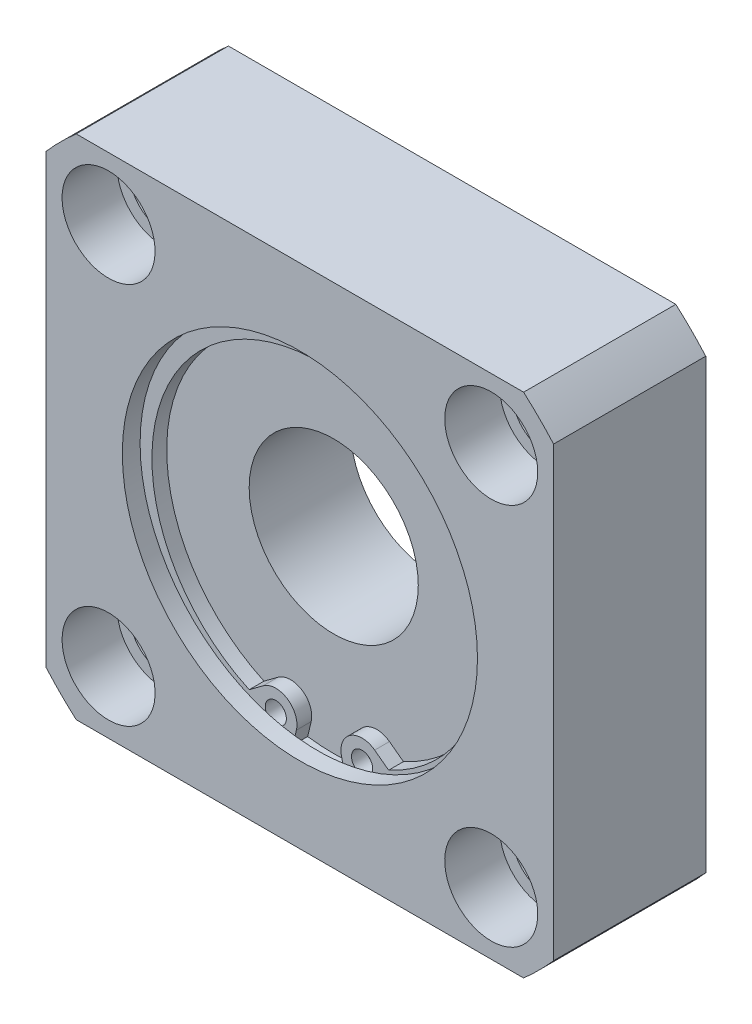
ISO-10303-21;
HEADER;
FILE_DESCRIPTION(('STEP AP214'),'2;1');
FILE_NAME('part.step','',(''),(''),'','','');
FILE_SCHEMA(('AUTOMOTIVE_DESIGN { 1 0 10303 214 1 1 1 1 }'));
ENDSEC;
DATA;
#1=APPLICATION_CONTEXT('core data for automotive mechanical design processes');
#2=APPLICATION_PROTOCOL_DEFINITION('international standard','automotive_design',2000,#1);
#3=PRODUCT_CONTEXT('',#1,'mechanical');
#4=PRODUCT('Part','Part','',(#3));
#5=PRODUCT_RELATED_PRODUCT_CATEGORY('part','',(#4));
#6=PRODUCT_DEFINITION_FORMATION('','',#4);
#7=PRODUCT_DEFINITION_CONTEXT('part definition',#1,'design');
#8=PRODUCT_DEFINITION('design','',#6,#7);
#9=PRODUCT_DEFINITION_SHAPE('','',#8);
#10=(LENGTH_UNIT() NAMED_UNIT(*) SI_UNIT(.MILLI.,.METRE.));
#11=(NAMED_UNIT(*) PLANE_ANGLE_UNIT() SI_UNIT($,.RADIAN.));
#12=(NAMED_UNIT(*) SI_UNIT($,.STERADIAN.) SOLID_ANGLE_UNIT());
#13=UNCERTAINTY_MEASURE_WITH_UNIT(LENGTH_MEASURE(1.E-05),#10,'distance_accuracy_value','');
#14=(GEOMETRIC_REPRESENTATION_CONTEXT(3) GLOBAL_UNCERTAINTY_ASSIGNED_CONTEXT((#13)) GLOBAL_UNIT_ASSIGNED_CONTEXT((#10,
#11,#12)) REPRESENTATION_CONTEXT('',''));
#15=CARTESIAN_POINT('',(0.,0.,0.));
#16=DIRECTION('',(0.,0.,1.));
#17=DIRECTION('',(1.,0.,0.));
#18=AXIS2_PLACEMENT_3D('',#15,#16,#17);
#19=CARTESIAN_POINT('',(22.6274169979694,22.6274169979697,0.));
#20=DIRECTION('',(0.,0.,1.));
#21=DIRECTION('',(1.,0.,0.));
#22=AXIS2_PLACEMENT_3D('',#19,#20,#21);
#23=CYLINDRICAL_SURFACE('',#22,4.);
#24=CARTESIAN_POINT('',(22.6274169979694,22.6274169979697,0.));
#25=DIRECTION('',(0.,0.,1.));
#26=DIRECTION('',(1.,0.,0.));
#27=AXIS2_PLACEMENT_3D('',#24,#25,#26);
#28=CIRCLE('',#27,4.);
#29=CARTESIAN_POINT('',(26.6274169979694,22.6274169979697,0.));
#30=VERTEX_POINT('',#29);
#31=EDGE_CURVE('E318',#30,#30,#28,.T.);
#32=ORIENTED_EDGE('',*,*,#31,.F.);
#33=EDGE_LOOP('',(#32));
#34=FACE_BOUND('',#33,.T.);
#35=CARTESIAN_POINT('',(22.6274169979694,22.6274169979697,11.5));
#36=DIRECTION('',(0.,0.,1.));
#37=DIRECTION('',(1.,0.,0.));
#38=AXIS2_PLACEMENT_3D('',#35,#36,#37);
#39=CIRCLE('',#38,4.);
#40=CARTESIAN_POINT('',(26.6274169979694,22.6274169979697,11.5));
#41=VERTEX_POINT('',#40);
#42=EDGE_CURVE('E315',#41,#41,#39,.F.);
#43=ORIENTED_EDGE('',*,*,#42,.F.);
#44=EDGE_LOOP('',(#43));
#45=FACE_BOUND('',#44,.T.);
#46=ADVANCED_FACE('F14',(#34,#45),#23,.F.);
#47=CARTESIAN_POINT('',(22.6274169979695,-22.6274169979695,0.));
#48=DIRECTION('',(0.,0.,1.));
#49=DIRECTION('',(1.,0.,0.));
#50=AXIS2_PLACEMENT_3D('',#47,#48,#49);
#51=CYLINDRICAL_SURFACE('',#50,4.);
#52=CARTESIAN_POINT('',(22.6274169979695,-22.6274169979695,0.));
#53=DIRECTION('',(0.,0.,1.));
#54=DIRECTION('',(0.,-1.,0.));
#55=AXIS2_PLACEMENT_3D('',#52,#53,#54);
#56=CIRCLE('',#55,4.);
#57=CARTESIAN_POINT('',(22.6274169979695,-26.6274169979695,0.));
#58=VERTEX_POINT('',#57);
#59=EDGE_CURVE('E387',#58,#58,#56,.T.);
#60=ORIENTED_EDGE('',*,*,#59,.F.);
#61=EDGE_LOOP('',(#60));
#62=FACE_BOUND('',#61,.T.);
#63=CARTESIAN_POINT('',(22.6274169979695,-22.6274169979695,11.5));
#64=DIRECTION('',(0.,0.,1.));
#65=DIRECTION('',(1.,0.,0.));
#66=AXIS2_PLACEMENT_3D('',#63,#64,#65);
#67=CIRCLE('',#66,4.);
#68=CARTESIAN_POINT('',(26.6274169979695,-22.6274169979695,11.5));
#69=VERTEX_POINT('',#68);
#70=EDGE_CURVE('E310',#69,#69,#67,.F.);
#71=ORIENTED_EDGE('',*,*,#70,.F.);
#72=EDGE_LOOP('',(#71));
#73=FACE_BOUND('',#72,.T.);
#74=ADVANCED_FACE('F508',(#62,#73),#51,.F.);
#75=CARTESIAN_POINT('',(-22.6274169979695,-22.6274169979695,0.));
#76=DIRECTION('',(0.,0.,1.));
#77=DIRECTION('',(1.,0.,0.));
#78=AXIS2_PLACEMENT_3D('',#75,#76,#77);
#79=CYLINDRICAL_SURFACE('',#78,4.);
#80=CARTESIAN_POINT('',(-22.6274169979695,-22.6274169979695,0.));
#81=DIRECTION('',(0.,0.,1.));
#82=DIRECTION('',(-1.,0.,0.));
#83=AXIS2_PLACEMENT_3D('',#80,#81,#82);
#84=CIRCLE('',#83,4.);
#85=CARTESIAN_POINT('',(-26.6274169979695,-22.6274169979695,0.));
#86=VERTEX_POINT('',#85);
#87=EDGE_CURVE('E390',#86,#86,#84,.T.);
#88=ORIENTED_EDGE('',*,*,#87,.F.);
#89=EDGE_LOOP('',(#88));
#90=FACE_BOUND('',#89,.T.);
#91=CARTESIAN_POINT('',(-22.6274169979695,-22.6274169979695,11.5));
#92=DIRECTION('',(0.,0.,1.));
#93=DIRECTION('',(1.,0.,0.));
#94=AXIS2_PLACEMENT_3D('',#91,#92,#93);
#95=CIRCLE('',#94,4.);
#96=CARTESIAN_POINT('',(-18.6274169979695,-22.6274169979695,11.5));
#97=VERTEX_POINT('',#96);
#98=EDGE_CURVE('E305',#97,#97,#95,.F.);
#99=ORIENTED_EDGE('',*,*,#98,.F.);
#100=EDGE_LOOP('',(#99));
#101=FACE_BOUND('',#100,.T.);
#102=ADVANCED_FACE('F514',(#90,#101),#79,.F.);
#103=CARTESIAN_POINT('',(-22.6274169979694,22.6274169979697,0.));
#104=DIRECTION('',(0.,0.,1.));
#105=DIRECTION('',(1.,0.,0.));
#106=AXIS2_PLACEMENT_3D('',#103,#104,#105);
#107=CYLINDRICAL_SURFACE('',#106,4.);
#108=CARTESIAN_POINT('',(-22.6274169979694,22.6274169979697,0.));
#109=DIRECTION('',(0.,0.,1.));
#110=DIRECTION('',(0.,1.,0.));
#111=AXIS2_PLACEMENT_3D('',#108,#109,#110);
#112=CIRCLE('',#111,4.);
#113=CARTESIAN_POINT('',(-22.6274169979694,26.6274169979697,0.));
#114=VERTEX_POINT('',#113);
#115=EDGE_CURVE('E313',#114,#114,#112,.T.);
#116=ORIENTED_EDGE('',*,*,#115,.F.);
#117=EDGE_LOOP('',(#116));
#118=FACE_BOUND('',#117,.T.);
#119=CARTESIAN_POINT('',(-22.6274169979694,22.6274169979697,11.5));
#120=DIRECTION('',(0.,0.,1.));
#121=DIRECTION('',(1.,0.,0.));
#122=AXIS2_PLACEMENT_3D('',#119,#120,#121);
#123=CIRCLE('',#122,4.);
#124=CARTESIAN_POINT('',(-18.6274169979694,22.6274169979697,11.5));
#125=VERTEX_POINT('',#124);
#126=EDGE_CURVE('E300',#125,#125,#123,.F.);
#127=ORIENTED_EDGE('',*,*,#126,.F.);
#128=EDGE_LOOP('',(#127));
#129=FACE_BOUND('',#128,.T.);
#130=ADVANCED_FACE('F554',(#118,#129),#107,.F.);
#131=CARTESIAN_POINT('',(22.6274169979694,22.6274169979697,11.5));
#132=DIRECTION('',(0.,0.,1.));
#133=DIRECTION('',(1.,0.,0.));
#134=AXIS2_PLACEMENT_3D('',#131,#132,#133);
#135=PLANE('',#134);
#136=CARTESIAN_POINT('',(22.6274169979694,22.6274169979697,11.5));
#137=DIRECTION('',(0.,0.,1.));
#138=DIRECTION('',(1.,0.,0.));
#139=AXIS2_PLACEMENT_3D('',#136,#137,#138);
#140=CIRCLE('',#139,5.5);
#141=CARTESIAN_POINT('',(28.1274169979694,22.6274169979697,11.5));
#142=VERTEX_POINT('',#141);
#143=EDGE_CURVE('E319',#142,#142,#140,.T.);
#144=ORIENTED_EDGE('',*,*,#143,.T.);
#145=EDGE_LOOP('',(#144));
#146=FACE_BOUND('',#145,.T.);
#147=ORIENTED_EDGE('',*,*,#42,.T.);
#148=EDGE_LOOP('',(#147));
#149=FACE_BOUND('',#148,.T.);
#150=ADVANCED_FACE('F545',(#146,#149),#135,.T.);
#151=CARTESIAN_POINT('',(22.6274169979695,-22.6274169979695,11.5));
#152=DIRECTION('',(0.,0.,1.));
#153=DIRECTION('',(0.,-1.,0.));
#154=AXIS2_PLACEMENT_3D('',#151,#152,#153);
#155=PLANE('',#154);
#156=CARTESIAN_POINT('',(22.6274169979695,-22.6274169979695,11.5));
#157=DIRECTION('',(0.,0.,1.));
#158=DIRECTION('',(0.,-1.,0.));
#159=AXIS2_PLACEMENT_3D('',#156,#157,#158);
#160=CIRCLE('',#159,5.5);
#161=CARTESIAN_POINT('',(22.6274169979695,-28.1274169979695,11.5));
#162=VERTEX_POINT('',#161);
#163=EDGE_CURVE('E314',#162,#162,#160,.T.);
#164=ORIENTED_EDGE('',*,*,#163,.T.);
#165=EDGE_LOOP('',(#164));
#166=FACE_BOUND('',#165,.T.);
#167=ORIENTED_EDGE('',*,*,#70,.T.);
#168=EDGE_LOOP('',(#167));
#169=FACE_BOUND('',#168,.T.);
#170=ADVANCED_FACE('F543',(#166,#169),#155,.T.);
#171=CARTESIAN_POINT('',(-22.6274169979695,-22.6274169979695,11.5));
#172=DIRECTION('',(0.,0.,1.));
#173=DIRECTION('',(-1.,0.,0.));
#174=AXIS2_PLACEMENT_3D('',#171,#172,#173);
#175=PLANE('',#174);
#176=CARTESIAN_POINT('',(-22.6274169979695,-22.6274169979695,11.5));
#177=DIRECTION('',(0.,0.,1.));
#178=DIRECTION('',(-1.,0.,0.));
#179=AXIS2_PLACEMENT_3D('',#176,#177,#178);
#180=CIRCLE('',#179,5.5);
#181=CARTESIAN_POINT('',(-28.1274169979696,-22.6274169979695,11.5));
#182=VERTEX_POINT('',#181);
#183=EDGE_CURVE('E309',#182,#182,#180,.T.);
#184=ORIENTED_EDGE('',*,*,#183,.T.);
#185=EDGE_LOOP('',(#184));
#186=FACE_BOUND('',#185,.T.);
#187=ORIENTED_EDGE('',*,*,#98,.T.);
#188=EDGE_LOOP('',(#187));
#189=FACE_BOUND('',#188,.T.);
#190=ADVANCED_FACE('F529',(#186,#189),#175,.T.);
#191=CARTESIAN_POINT('',(-22.6274169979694,22.6274169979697,11.5));
#192=DIRECTION('',(0.,0.,1.));
#193=DIRECTION('',(0.,1.,0.));
#194=AXIS2_PLACEMENT_3D('',#191,#192,#193);
#195=PLANE('',#194);
#196=CARTESIAN_POINT('',(-22.6274169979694,22.6274169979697,11.5));
#197=DIRECTION('',(0.,0.,1.));
#198=DIRECTION('',(0.,1.,0.));
#199=AXIS2_PLACEMENT_3D('',#196,#197,#198);
#200=CIRCLE('',#199,5.5);
#201=CARTESIAN_POINT('',(-22.6274169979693,28.1274169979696,11.5));
#202=VERTEX_POINT('',#201);
#203=EDGE_CURVE('E304',#202,#202,#200,.T.);
#204=ORIENTED_EDGE('',*,*,#203,.T.);
#205=EDGE_LOOP('',(#204));
#206=FACE_BOUND('',#205,.T.);
#207=ORIENTED_EDGE('',*,*,#126,.T.);
#208=EDGE_LOOP('',(#207));
#209=FACE_BOUND('',#208,.T.);
#210=ADVANCED_FACE('F524',(#206,#209),#195,.T.);
#211=CARTESIAN_POINT('',(0.,0.,0.));
#212=DIRECTION('',(0.,0.,-1.));
#213=DIRECTION('',(-1.,0.,0.));
#214=AXIS2_PLACEMENT_3D('',#211,#212,#213);
#215=PLANE('',#214);
#216=CARTESIAN_POINT('',(0.,0.,0.));
#217=DIRECTION('',(0.,0.,-1.));
#218=DIRECTION('',(-1.,0.,0.));
#219=AXIS2_PLACEMENT_3D('',#216,#217,#218);
#220=CIRCLE('',#219,18.);
#221=CARTESIAN_POINT('',(-18.,0.,0.));
#222=VERTEX_POINT('',#221);
#223=EDGE_CURVE('E289',#222,#222,#220,.T.);
#224=ORIENTED_EDGE('',*,*,#223,.F.);
#225=EDGE_LOOP('',(#224));
#226=FACE_BOUND('',#225,.T.);
#227=ORIENTED_EDGE('',*,*,#115,.T.);
#228=EDGE_LOOP('',(#227));
#229=FACE_BOUND('',#228,.T.);
#230=ORIENTED_EDGE('',*,*,#87,.T.);
#231=EDGE_LOOP('',(#230));
#232=FACE_BOUND('',#231,.T.);
#233=ORIENTED_EDGE('',*,*,#59,.T.);
#234=EDGE_LOOP('',(#233));
#235=FACE_BOUND('',#234,.T.);
#236=ORIENTED_EDGE('',*,*,#31,.T.);
#237=EDGE_LOOP('',(#236));
#238=FACE_BOUND('',#237,.T.);
#239=CARTESIAN_POINT('',(0.,0.,0.));
#240=DIRECTION('',(0.,0.,-1.));
#241=DIRECTION('',(-1.,0.,0.));
#242=AXIS2_PLACEMENT_3D('',#239,#240,#241);
#243=CIRCLE('',#242,40.);
#244=CARTESIAN_POINT('',(30.,-26.4575131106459,0.));
#245=VERTEX_POINT('',#244);
#246=CARTESIAN_POINT('',(26.4575131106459,-30.,0.));
#247=VERTEX_POINT('',#246);
#248=EDGE_CURVE('E378',#245,#247,#243,.T.);
#249=ORIENTED_EDGE('',*,*,#248,.T.);
#250=DIRECTION('',(1.,0.,0.));
#251=VECTOR('',#250,1.);
#252=CARTESIAN_POINT('',(-26.4575131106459,-30.,0.));
#253=LINE('',#252,#251);
#254=CARTESIAN_POINT('',(-26.4575131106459,-30.,0.));
#255=VERTEX_POINT('',#254);
#256=EDGE_CURVE('E375',#255,#247,#253,.T.);
#257=ORIENTED_EDGE('',*,*,#256,.F.);
#258=CARTESIAN_POINT('',(0.,0.,0.));
#259=DIRECTION('',(0.,0.,1.));
#260=DIRECTION('',(1.,0.,0.));
#261=AXIS2_PLACEMENT_3D('',#258,#259,#260);
#262=CIRCLE('',#261,40.);
#263=CARTESIAN_POINT('',(-30.,-26.4575131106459,0.));
#264=VERTEX_POINT('',#263);
#265=EDGE_CURVE('E372',#264,#255,#262,.T.);
#266=ORIENTED_EDGE('',*,*,#265,.F.);
#267=DIRECTION('',(0.,1.,0.));
#268=VECTOR('',#267,1.);
#269=CARTESIAN_POINT('',(-30.,-26.4575131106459,0.));
#270=LINE('',#269,#268);
#271=CARTESIAN_POINT('',(-30.,26.4575131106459,0.));
#272=VERTEX_POINT('',#271);
#273=EDGE_CURVE('E369',#264,#272,#270,.T.);
#274=ORIENTED_EDGE('',*,*,#273,.T.);
#275=CARTESIAN_POINT('',(0.,0.,0.));
#276=DIRECTION('',(0.,0.,-1.));
#277=DIRECTION('',(-1.,0.,0.));
#278=AXIS2_PLACEMENT_3D('',#275,#276,#277);
#279=CIRCLE('',#278,40.);
#280=CARTESIAN_POINT('',(-26.4575131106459,30.,0.));
#281=VERTEX_POINT('',#280);
#282=EDGE_CURVE('E366',#272,#281,#279,.T.);
#283=ORIENTED_EDGE('',*,*,#282,.T.);
#284=DIRECTION('',(1.,0.,0.));
#285=VECTOR('',#284,1.);
#286=CARTESIAN_POINT('',(-26.4575131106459,30.,0.));
#287=LINE('',#286,#285);
#288=CARTESIAN_POINT('',(26.4575131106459,30.,0.));
#289=VERTEX_POINT('',#288);
#290=EDGE_CURVE('E363',#281,#289,#287,.T.);
#291=ORIENTED_EDGE('',*,*,#290,.T.);
#292=CARTESIAN_POINT('',(0.,0.,0.));
#293=DIRECTION('',(0.,0.,1.));
#294=DIRECTION('',(1.,0.,0.));
#295=AXIS2_PLACEMENT_3D('',#292,#293,#294);
#296=CIRCLE('',#295,40.);
#297=CARTESIAN_POINT('',(30.,26.4575131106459,0.));
#298=VERTEX_POINT('',#297);
#299=EDGE_CURVE('E360',#298,#289,#296,.T.);
#300=ORIENTED_EDGE('',*,*,#299,.F.);
#301=DIRECTION('',(0.,1.,0.));
#302=VECTOR('',#301,1.);
#303=CARTESIAN_POINT('',(30.,-26.4575131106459,0.));
#304=LINE('',#303,#302);
#305=EDGE_CURVE('E357',#245,#298,#304,.T.);
#306=ORIENTED_EDGE('',*,*,#305,.F.);
#307=EDGE_LOOP('',(#249,#257,#266,#274,#283,#291,#300,#306));
#308=FACE_BOUND('',#307,.T.);
#309=ADVANCED_FACE('F477',(#226,#229,#232,#235,#238,#308),#215,.T.);
#310=CARTESIAN_POINT('',(-26.4575131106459,-30.,18.));
#311=DIRECTION('',(0.,1.,0.));
#312=DIRECTION('',(0.,0.,1.));
#313=AXIS2_PLACEMENT_3D('',#310,#311,#312);
#314=PLANE('',#313);
#315=DIRECTION('',(1.,0.,0.));
#316=VECTOR('',#315,1.);
#317=CARTESIAN_POINT('',(-26.4575131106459,-30.,18.));
#318=LINE('',#317,#316);
#319=CARTESIAN_POINT('',(-26.4575131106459,-30.,18.));
#320=VERTEX_POINT('',#319);
#321=CARTESIAN_POINT('',(26.4575131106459,-30.,18.));
#322=VERTEX_POINT('',#321);
#323=EDGE_CURVE('E352',#320,#322,#318,.T.);
#324=ORIENTED_EDGE('',*,*,#323,.F.);
#325=DIRECTION('',(0.,0.,-1.));
#326=VECTOR('',#325,1.);
#327=CARTESIAN_POINT('',(-26.4575131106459,-30.,18.));
#328=LINE('',#327,#326);
#329=EDGE_CURVE('E331',#320,#255,#328,.T.);
#330=ORIENTED_EDGE('',*,*,#329,.T.);
#331=ORIENTED_EDGE('',*,*,#256,.T.);
#332=DIRECTION('',(0.,0.,-1.));
#333=VECTOR('',#332,1.);
#334=CARTESIAN_POINT('',(26.4575131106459,-30.,18.));
#335=LINE('',#334,#333);
#336=EDGE_CURVE('E74',#322,#247,#335,.T.);
#337=ORIENTED_EDGE('',*,*,#336,.F.);
#338=EDGE_LOOP('',(#324,#330,#331,#337));
#339=FACE_BOUND('',#338,.T.);
#340=ADVANCED_FACE('F475',(#339),#314,.F.);
#341=CARTESIAN_POINT('',(0.,0.,18.));
#342=DIRECTION('',(0.,0.,-1.));
#343=DIRECTION('',(-1.,0.,0.));
#344=AXIS2_PLACEMENT_3D('',#341,#342,#343);
#345=CYLINDRICAL_SURFACE('',#344,40.);
#346=ORIENTED_EDGE('',*,*,#329,.F.);
#347=CARTESIAN_POINT('',(0.,0.,18.));
#348=DIRECTION('',(0.,0.,1.));
#349=DIRECTION('',(1.,0.,0.));
#350=AXIS2_PLACEMENT_3D('',#347,#348,#349);
#351=CIRCLE('',#350,40.);
#352=CARTESIAN_POINT('',(-30.,-26.4575131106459,18.));
#353=VERTEX_POINT('',#352);
#354=EDGE_CURVE('E349',#353,#320,#351,.T.);
#355=ORIENTED_EDGE('',*,*,#354,.F.);
#356=DIRECTION('',(0.,0.,-1.));
#357=VECTOR('',#356,1.);
#358=CARTESIAN_POINT('',(-30.,-26.4575131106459,18.));
#359=LINE('',#358,#357);
#360=EDGE_CURVE('E329',#353,#264,#359,.T.);
#361=ORIENTED_EDGE('',*,*,#360,.T.);
#362=ORIENTED_EDGE('',*,*,#265,.T.);
#363=EDGE_LOOP('',(#346,#355,#361,#362));
#364=FACE_BOUND('',#363,.T.);
#365=ADVANCED_FACE('F471',(#364),#345,.T.);
#366=CARTESIAN_POINT('',(-30.,-26.4575131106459,18.));
#367=DIRECTION('',(-1.,0.,0.));
#368=DIRECTION('',(0.,0.,1.));
#369=AXIS2_PLACEMENT_3D('',#366,#367,#368);
#370=PLANE('',#369);
#371=ORIENTED_EDGE('',*,*,#360,.F.);
#372=DIRECTION('',(0.,1.,0.));
#373=VECTOR('',#372,1.);
#374=CARTESIAN_POINT('',(-30.,-26.4575131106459,18.));
#375=LINE('',#374,#373);
#376=CARTESIAN_POINT('',(-30.,26.4575131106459,18.));
#377=VERTEX_POINT('',#376);
#378=EDGE_CURVE('E346',#353,#377,#375,.T.);
#379=ORIENTED_EDGE('',*,*,#378,.T.);
#380=DIRECTION('',(0.,0.,-1.));
#381=VECTOR('',#380,1.);
#382=CARTESIAN_POINT('',(-30.,26.4575131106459,18.));
#383=LINE('',#382,#381);
#384=EDGE_CURVE('E327',#377,#272,#383,.T.);
#385=ORIENTED_EDGE('',*,*,#384,.T.);
#386=ORIENTED_EDGE('',*,*,#273,.F.);
#387=EDGE_LOOP('',(#371,#379,#385,#386));
#388=FACE_BOUND('',#387,.T.);
#389=ADVANCED_FACE('F468',(#388),#370,.T.);
#390=CARTESIAN_POINT('',(0.,0.,18.));
#391=DIRECTION('',(0.,0.,-1.));
#392=DIRECTION('',(-1.,0.,0.));
#393=AXIS2_PLACEMENT_3D('',#390,#391,#392);
#394=CYLINDRICAL_SURFACE('',#393,40.);
#395=ORIENTED_EDGE('',*,*,#384,.F.);
#396=CARTESIAN_POINT('',(0.,0.,18.));
#397=DIRECTION('',(0.,0.,-1.));
#398=DIRECTION('',(-1.,0.,0.));
#399=AXIS2_PLACEMENT_3D('',#396,#397,#398);
#400=CIRCLE('',#399,40.);
#401=CARTESIAN_POINT('',(-26.4575131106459,30.,18.));
#402=VERTEX_POINT('',#401);
#403=EDGE_CURVE('E343',#377,#402,#400,.T.);
#404=ORIENTED_EDGE('',*,*,#403,.T.);
#405=DIRECTION('',(0.,0.,-1.));
#406=VECTOR('',#405,1.);
#407=CARTESIAN_POINT('',(-26.4575131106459,30.,18.));
#408=LINE('',#407,#406);
#409=EDGE_CURVE('E325',#402,#281,#408,.T.);
#410=ORIENTED_EDGE('',*,*,#409,.T.);
#411=ORIENTED_EDGE('',*,*,#282,.F.);
#412=EDGE_LOOP('',(#395,#404,#410,#411));
#413=FACE_BOUND('',#412,.T.);
#414=ADVANCED_FACE('F465',(#413),#394,.T.);
#415=CARTESIAN_POINT('',(-26.4575131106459,30.,18.));
#416=DIRECTION('',(0.,1.,0.));
#417=DIRECTION('',(0.,0.,1.));
#418=AXIS2_PLACEMENT_3D('',#415,#416,#417);
#419=PLANE('',#418);
#420=ORIENTED_EDGE('',*,*,#409,.F.);
#421=DIRECTION('',(1.,0.,0.));
#422=VECTOR('',#421,1.);
#423=CARTESIAN_POINT('',(-26.4575131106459,30.,18.));
#424=LINE('',#423,#422);
#425=CARTESIAN_POINT('',(26.4575131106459,30.,18.));
#426=VERTEX_POINT('',#425);
#427=EDGE_CURVE('E340',#402,#426,#424,.T.);
#428=ORIENTED_EDGE('',*,*,#427,.T.);
#429=DIRECTION('',(0.,0.,-1.));
#430=VECTOR('',#429,1.);
#431=CARTESIAN_POINT('',(26.4575131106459,30.,18.));
#432=LINE('',#431,#430);
#433=EDGE_CURVE('E323',#426,#289,#432,.T.);
#434=ORIENTED_EDGE('',*,*,#433,.T.);
#435=ORIENTED_EDGE('',*,*,#290,.F.);
#436=EDGE_LOOP('',(#420,#428,#434,#435));
#437=FACE_BOUND('',#436,.T.);
#438=ADVANCED_FACE('F461',(#437),#419,.T.);
#439=CARTESIAN_POINT('',(0.,0.,18.));
#440=DIRECTION('',(0.,0.,-1.));
#441=DIRECTION('',(-1.,0.,0.));
#442=AXIS2_PLACEMENT_3D('',#439,#440,#441);
#443=CYLINDRICAL_SURFACE('',#442,40.);
#444=ORIENTED_EDGE('',*,*,#433,.F.);
#445=CARTESIAN_POINT('',(0.,0.,18.));
#446=DIRECTION('',(0.,0.,1.));
#447=DIRECTION('',(1.,0.,0.));
#448=AXIS2_PLACEMENT_3D('',#445,#446,#447);
#449=CIRCLE('',#448,40.);
#450=CARTESIAN_POINT('',(30.,26.4575131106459,18.));
#451=VERTEX_POINT('',#450);
#452=EDGE_CURVE('E337',#451,#426,#449,.T.);
#453=ORIENTED_EDGE('',*,*,#452,.F.);
#454=DIRECTION('',(0.,0.,-1.));
#455=VECTOR('',#454,1.);
#456=CARTESIAN_POINT('',(30.,26.4575131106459,18.));
#457=LINE('',#456,#455);
#458=EDGE_CURVE('E321',#451,#298,#457,.T.);
#459=ORIENTED_EDGE('',*,*,#458,.T.);
#460=ORIENTED_EDGE('',*,*,#299,.T.);
#461=EDGE_LOOP('',(#444,#453,#459,#460));
#462=FACE_BOUND('',#461,.T.);
#463=ADVANCED_FACE('F456',(#462),#443,.T.);
#464=CARTESIAN_POINT('',(30.,-26.4575131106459,18.));
#465=DIRECTION('',(-1.,0.,0.));
#466=DIRECTION('',(0.,0.,1.));
#467=AXIS2_PLACEMENT_3D('',#464,#465,#466);
#468=PLANE('',#467);
#469=ORIENTED_EDGE('',*,*,#458,.F.);
#470=DIRECTION('',(0.,1.,0.));
#471=VECTOR('',#470,1.);
#472=CARTESIAN_POINT('',(30.,-26.4575131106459,18.));
#473=LINE('',#472,#471);
#474=CARTESIAN_POINT('',(30.,-26.4575131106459,18.));
#475=VERTEX_POINT('',#474);
#476=EDGE_CURVE('E334',#475,#451,#473,.T.);
#477=ORIENTED_EDGE('',*,*,#476,.F.);
#478=DIRECTION('',(0.,0.,-1.));
#479=VECTOR('',#478,1.);
#480=CARTESIAN_POINT('',(30.,-26.4575131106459,18.));
#481=LINE('',#480,#479);
#482=EDGE_CURVE('E285',#475,#245,#481,.T.);
#483=ORIENTED_EDGE('',*,*,#482,.T.);
#484=ORIENTED_EDGE('',*,*,#305,.T.);
#485=EDGE_LOOP('',(#469,#477,#483,#484));
#486=FACE_BOUND('',#485,.T.);
#487=ADVANCED_FACE('F451',(#486),#468,.F.);
#488=CARTESIAN_POINT('',(0.,0.,18.));
#489=DIRECTION('',(0.,0.,-1.));
#490=DIRECTION('',(-1.,0.,0.));
#491=AXIS2_PLACEMENT_3D('',#488,#489,#490);
#492=CYLINDRICAL_SURFACE('',#491,40.);
#493=ORIENTED_EDGE('',*,*,#482,.F.);
#494=CARTESIAN_POINT('',(0.,0.,18.));
#495=DIRECTION('',(0.,0.,-1.));
#496=DIRECTION('',(-1.,0.,0.));
#497=AXIS2_PLACEMENT_3D('',#494,#495,#496);
#498=CIRCLE('',#497,40.);
#499=EDGE_CURVE('E355',#475,#322,#498,.T.);
#500=ORIENTED_EDGE('',*,*,#499,.T.);
#501=ORIENTED_EDGE('',*,*,#336,.T.);
#502=ORIENTED_EDGE('',*,*,#248,.F.);
#503=EDGE_LOOP('',(#493,#500,#501,#502));
#504=FACE_BOUND('',#503,.T.);
#505=ADVANCED_FACE('F478',(#504),#492,.T.);
#506=CARTESIAN_POINT('',(22.6274169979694,22.6274169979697,11.5));
#507=DIRECTION('',(0.,0.,1.));
#508=DIRECTION('',(1.,0.,0.));
#509=AXIS2_PLACEMENT_3D('',#506,#507,#508);
#510=CYLINDRICAL_SURFACE('',#509,5.5);
#511=ORIENTED_EDGE('',*,*,#143,.F.);
#512=EDGE_LOOP('',(#511));
#513=FACE_BOUND('',#512,.T.);
#514=CARTESIAN_POINT('',(22.6274169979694,22.6274169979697,18.));
#515=DIRECTION('',(0.,0.,1.));
#516=DIRECTION('',(1.,0.,0.));
#517=AXIS2_PLACEMENT_3D('',#514,#515,#516);
#518=CIRCLE('',#517,5.5);
#519=CARTESIAN_POINT('',(28.1274169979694,22.6274169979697,18.));
#520=VERTEX_POINT('',#519);
#521=EDGE_CURVE('E384',#520,#520,#518,.T.);
#522=ORIENTED_EDGE('',*,*,#521,.T.);
#523=EDGE_LOOP('',(#522));
#524=FACE_BOUND('',#523,.T.);
#525=ADVANCED_FACE('F480',(#513,#524),#510,.F.);
#526=CARTESIAN_POINT('',(22.6274169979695,-22.6274169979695,11.5));
#527=DIRECTION('',(0.,0.,1.));
#528=DIRECTION('',(1.,0.,0.));
#529=AXIS2_PLACEMENT_3D('',#526,#527,#528);
#530=CYLINDRICAL_SURFACE('',#529,5.5);
#531=ORIENTED_EDGE('',*,*,#163,.F.);
#532=EDGE_LOOP('',(#531));
#533=FACE_BOUND('',#532,.T.);
#534=CARTESIAN_POINT('',(22.6274169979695,-22.6274169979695,18.));
#535=DIRECTION('',(0.,0.,1.));
#536=DIRECTION('',(0.,-1.,0.));
#537=AXIS2_PLACEMENT_3D('',#534,#535,#536);
#538=CIRCLE('',#537,5.5);
#539=CARTESIAN_POINT('',(22.6274169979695,-28.1274169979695,18.));
#540=VERTEX_POINT('',#539);
#541=EDGE_CURVE('E308',#540,#540,#538,.T.);
#542=ORIENTED_EDGE('',*,*,#541,.T.);
#543=EDGE_LOOP('',(#542));
#544=FACE_BOUND('',#543,.T.);
#545=ADVANCED_FACE('F486',(#533,#544),#530,.F.);
#546=CARTESIAN_POINT('',(-22.6274169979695,-22.6274169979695,11.5));
#547=DIRECTION('',(0.,0.,1.));
#548=DIRECTION('',(1.,0.,0.));
#549=AXIS2_PLACEMENT_3D('',#546,#547,#548);
#550=CYLINDRICAL_SURFACE('',#549,5.5);
#551=ORIENTED_EDGE('',*,*,#183,.F.);
#552=EDGE_LOOP('',(#551));
#553=FACE_BOUND('',#552,.T.);
#554=CARTESIAN_POINT('',(-22.6274169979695,-22.6274169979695,18.));
#555=DIRECTION('',(0.,0.,1.));
#556=DIRECTION('',(-1.,0.,0.));
#557=AXIS2_PLACEMENT_3D('',#554,#555,#556);
#558=CIRCLE('',#557,5.5);
#559=CARTESIAN_POINT('',(-28.1274169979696,-22.6274169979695,18.));
#560=VERTEX_POINT('',#559);
#561=EDGE_CURVE('E303',#560,#560,#558,.T.);
#562=ORIENTED_EDGE('',*,*,#561,.T.);
#563=EDGE_LOOP('',(#562));
#564=FACE_BOUND('',#563,.T.);
#565=ADVANCED_FACE('F558',(#553,#564),#550,.F.);
#566=CARTESIAN_POINT('',(-22.6274169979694,22.6274169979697,11.5));
#567=DIRECTION('',(0.,0.,1.));
#568=DIRECTION('',(1.,0.,0.));
#569=AXIS2_PLACEMENT_3D('',#566,#567,#568);
#570=CYLINDRICAL_SURFACE('',#569,5.5);
#571=ORIENTED_EDGE('',*,*,#203,.F.);
#572=EDGE_LOOP('',(#571));
#573=FACE_BOUND('',#572,.T.);
#574=CARTESIAN_POINT('',(-22.6274169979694,22.6274169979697,18.));
#575=DIRECTION('',(0.,0.,1.));
#576=DIRECTION('',(0.,1.,0.));
#577=AXIS2_PLACEMENT_3D('',#574,#575,#576);
#578=CIRCLE('',#577,5.5);
#579=CARTESIAN_POINT('',(-22.6274169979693,28.1274169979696,18.));
#580=VERTEX_POINT('',#579);
#581=EDGE_CURVE('E299',#580,#580,#578,.T.);
#582=ORIENTED_EDGE('',*,*,#581,.T.);
#583=EDGE_LOOP('',(#582));
#584=FACE_BOUND('',#583,.T.);
#585=ADVANCED_FACE('F680',(#573,#584),#570,.F.);
#586=CARTESIAN_POINT('',(0.,0.,2.));
#587=DIRECTION('',(0.,0.,-1.));
#588=DIRECTION('',(-1.,0.,0.));
#589=AXIS2_PLACEMENT_3D('',#586,#587,#588);
#590=CYLINDRICAL_SURFACE('',#589,18.);
#591=CARTESIAN_POINT('',(0.,0.,2.));
#592=DIRECTION('',(0.,0.,-1.));
#593=DIRECTION('',(-1.,0.,0.));
#594=AXIS2_PLACEMENT_3D('',#591,#592,#593);
#595=CIRCLE('',#594,18.);
#596=CARTESIAN_POINT('',(-18.,0.,2.));
#597=VERTEX_POINT('',#596);
#598=EDGE_CURVE('E295',#597,#597,#595,.T.);
#599=ORIENTED_EDGE('',*,*,#598,.F.);
#600=EDGE_LOOP('',(#599));
#601=FACE_BOUND('',#600,.T.);
#602=ORIENTED_EDGE('',*,*,#223,.T.);
#603=EDGE_LOOP('',(#602));
#604=FACE_BOUND('',#603,.T.);
#605=ADVANCED_FACE('F437',(#601,#604),#590,.F.);
#606=CARTESIAN_POINT('',(0.,0.,18.));
#607=DIRECTION('',(0.,0.,-1.));
#608=DIRECTION('',(-1.,0.,0.));
#609=AXIS2_PLACEMENT_3D('',#606,#607,#608);
#610=PLANE('',#609);
#611=CARTESIAN_POINT('',(0.,0.,18.));
#612=DIRECTION('',(0.,0.,1.));
#613=DIRECTION('',(1.,0.,0.));
#614=AXIS2_PLACEMENT_3D('',#611,#612,#613);
#615=CIRCLE('',#614,21.);
#616=CARTESIAN_POINT('',(21.,0.,18.));
#617=VERTEX_POINT('',#616);
#618=EDGE_CURVE('E294',#617,#617,#615,.T.);
#619=ORIENTED_EDGE('',*,*,#618,.F.);
#620=EDGE_LOOP('',(#619));
#621=FACE_BOUND('',#620,.T.);
#622=ORIENTED_EDGE('',*,*,#581,.F.);
#623=EDGE_LOOP('',(#622));
#624=FACE_BOUND('',#623,.T.);
#625=ORIENTED_EDGE('',*,*,#561,.F.);
#626=EDGE_LOOP('',(#625));
#627=FACE_BOUND('',#626,.T.);
#628=ORIENTED_EDGE('',*,*,#541,.F.);
#629=EDGE_LOOP('',(#628));
#630=FACE_BOUND('',#629,.T.);
#631=ORIENTED_EDGE('',*,*,#521,.F.);
#632=EDGE_LOOP('',(#631));
#633=FACE_BOUND('',#632,.T.);
#634=ORIENTED_EDGE('',*,*,#499,.F.);
#635=ORIENTED_EDGE('',*,*,#476,.T.);
#636=ORIENTED_EDGE('',*,*,#452,.T.);
#637=ORIENTED_EDGE('',*,*,#427,.F.);
#638=ORIENTED_EDGE('',*,*,#403,.F.);
#639=ORIENTED_EDGE('',*,*,#378,.F.);
#640=ORIENTED_EDGE('',*,*,#354,.T.);
#641=ORIENTED_EDGE('',*,*,#323,.T.);
#642=EDGE_LOOP('',(#634,#635,#636,#637,#638,#639,#640,#641));
#643=FACE_BOUND('',#642,.T.);
#644=ADVANCED_FACE('F434',(#621,#624,#627,#630,#633,#643),#610,.F.);
#645=CARTESIAN_POINT('',(0.,0.,2.));
#646=DIRECTION('',(0.,0.,-1.));
#647=DIRECTION('',(-1.,0.,0.));
#648=AXIS2_PLACEMENT_3D('',#645,#646,#647);
#649=PLANE('',#648);
#650=CARTESIAN_POINT('',(0.,0.,2.));
#651=DIRECTION('',(0.,0.,-1.));
#652=DIRECTION('',(-1.,0.,0.));
#653=AXIS2_PLACEMENT_3D('',#650,#651,#652);
#654=CIRCLE('',#653,10.);
#655=CARTESIAN_POINT('',(-10.,0.,2.));
#656=VERTEX_POINT('',#655);
#657=EDGE_CURVE('E291',#656,#656,#654,.T.);
#658=ORIENTED_EDGE('',*,*,#657,.F.);
#659=EDGE_LOOP('',(#658));
#660=FACE_BOUND('',#659,.T.);
#661=ORIENTED_EDGE('',*,*,#598,.T.);
#662=EDGE_LOOP('',(#661));
#663=FACE_BOUND('',#662,.T.);
#664=ADVANCED_FACE('F430',(#660,#663),#649,.T.);
#665=CARTESIAN_POINT('',(0.,0.,14.));
#666=DIRECTION('',(0.,0.,1.));
#667=DIRECTION('',(1.,0.,0.));
#668=AXIS2_PLACEMENT_3D('',#665,#666,#667);
#669=CYLINDRICAL_SURFACE('',#668,21.);
#670=CARTESIAN_POINT('',(0.,0.,15.9));
#671=DIRECTION('',(0.,0.,1.));
#672=DIRECTION('',(1.,0.,0.));
#673=AXIS2_PLACEMENT_3D('',#670,#671,#672);
#674=CIRCLE('',#673,21.);
#675=CARTESIAN_POINT('',(21.,0.,15.9));
#676=VERTEX_POINT('',#675);
#677=EDGE_CURVE('E286',#676,#676,#674,.F.);
#678=ORIENTED_EDGE('',*,*,#677,.T.);
#679=EDGE_LOOP('',(#678));
#680=FACE_BOUND('',#679,.T.);
#681=ORIENTED_EDGE('',*,*,#618,.T.);
#682=EDGE_LOOP('',(#681));
#683=FACE_BOUND('',#682,.T.);
#684=ADVANCED_FACE('F426',(#680,#683),#669,.F.);
#685=CARTESIAN_POINT('',(0.,0.,18.));
#686=DIRECTION('',(0.,0.,-1.));
#687=DIRECTION('',(-1.,0.,0.));
#688=AXIS2_PLACEMENT_3D('',#685,#686,#687);
#689=CYLINDRICAL_SURFACE('',#688,10.);
#690=CARTESIAN_POINT('',(0.,0.,14.));
#691=DIRECTION('',(0.,0.,1.));
#692=DIRECTION('',(1.,0.,0.));
#693=AXIS2_PLACEMENT_3D('',#690,#691,#692);
#694=CIRCLE('',#693,10.);
#695=CARTESIAN_POINT('',(10.,0.,14.));
#696=VERTEX_POINT('',#695);
#697=EDGE_CURVE('E296',#696,#696,#694,.T.);
#698=ORIENTED_EDGE('',*,*,#697,.T.);
#699=EDGE_LOOP('',(#698));
#700=FACE_BOUND('',#699,.T.);
#701=ORIENTED_EDGE('',*,*,#657,.T.);
#702=EDGE_LOOP('',(#701));
#703=FACE_BOUND('',#702,.T.);
#704=ADVANCED_FACE('F429',(#700,#703),#689,.F.);
#705=CARTESIAN_POINT('',(0.,0.,14.));
#706=DIRECTION('',(0.,0.,1.));
#707=DIRECTION('',(1.,0.,0.));
#708=AXIS2_PLACEMENT_3D('',#705,#706,#707);
#709=PLANE('',#708);
#710=ORIENTED_EDGE('',*,*,#697,.F.);
#711=EDGE_LOOP('',(#710));
#712=FACE_BOUND('',#711,.T.);
#713=CARTESIAN_POINT('',(0.,0.,14.));
#714=DIRECTION('',(0.,0.,1.));
#715=DIRECTION('',(1.,0.,0.));
#716=AXIS2_PLACEMENT_3D('',#713,#714,#715);
#717=CIRCLE('',#716,22.25);
#718=CARTESIAN_POINT('',(-3.07994479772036,-22.0357990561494,14.));
#719=VERTEX_POINT('',#718);
#720=CARTESIAN_POINT('',(3.07994479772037,-22.0357990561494,14.));
#721=VERTEX_POINT('',#720);
#722=EDGE_CURVE('E191',#719,#721,#717,.T.);
#723=ORIENTED_EDGE('',*,*,#722,.T.);
#724=DIRECTION('',(-0.231349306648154,0.972870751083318,0.));
#725=VECTOR('',#724,1.);
#726=CARTESIAN_POINT('',(-2.04456437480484,-0.486198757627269,14.));
#727=LINE('',#726,#725);
#728=CARTESIAN_POINT('',(2.6678231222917,-20.3027438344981,14.));
#729=VERTEX_POINT('',#728);
#730=EDGE_CURVE('E9',#721,#729,#727,.T.);
#731=ORIENTED_EDGE('',*,*,#730,.T.);
#732=CARTESIAN_POINT('',(5.1,-19.7243705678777,14.));
#733=DIRECTION('',(0.,0.,1.));
#734=DIRECTION('',(1.,0.,0.));
#735=AXIS2_PLACEMENT_3D('',#732,#733,#734);
#736=CIRCLE('',#735,2.5);
#737=CARTESIAN_POINT('',(6.59138441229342,-17.7179377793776,14.));
#738=VERTEX_POINT('',#737);
#739=EDGE_CURVE('E25',#738,#729,#736,.T.);
#740=ORIENTED_EDGE('',*,*,#739,.F.);
#741=DIRECTION('',(0.802573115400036,-0.596553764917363,0.));
#742=VECTOR('',#741,1.);
#743=CARTESIAN_POINT('',(-6.13724093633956,-8.25673202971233,14.));
#744=LINE('',#743,#742);
#745=CARTESIAN_POINT('',(8.24465388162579,-18.9468153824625,14.));
#746=VERTEX_POINT('',#745);
#747=EDGE_CURVE('E150',#738,#746,#744,.T.);
#748=ORIENTED_EDGE('',*,*,#747,.T.);
#749=CARTESIAN_POINT('',(0.,-1.,14.));
#750=DIRECTION('',(0.,0.,1.));
#751=DIRECTION('',(1.,0.,0.));
#752=AXIS2_PLACEMENT_3D('',#749,#750,#751);
#753=CIRCLE('',#752,19.75);
#754=CARTESIAN_POINT('',(-8.24465388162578,-18.9468153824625,14.));
#755=VERTEX_POINT('',#754);
#756=EDGE_CURVE('E154',#746,#755,#753,.T.);
#757=ORIENTED_EDGE('',*,*,#756,.T.);
#758=DIRECTION('',(0.802573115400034,0.596553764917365,0.));
#759=VECTOR('',#758,1.);
#760=CARTESIAN_POINT('',(6.13724093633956,-8.25673202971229,14.));
#761=LINE('',#760,#759);
#762=CARTESIAN_POINT('',(-6.59138441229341,-17.7179377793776,14.));
#763=VERTEX_POINT('',#762);
#764=EDGE_CURVE('E169',#755,#763,#761,.T.);
#765=ORIENTED_EDGE('',*,*,#764,.T.);
#766=CARTESIAN_POINT('',(-5.1,-19.7243705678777,14.));
#767=DIRECTION('',(0.,0.,1.));
#768=DIRECTION('',(1.,0.,0.));
#769=AXIS2_PLACEMENT_3D('',#766,#767,#768);
#770=CIRCLE('',#769,2.5);
#771=CARTESIAN_POINT('',(-2.6678231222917,-20.3027438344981,14.));
#772=VERTEX_POINT('',#771);
#773=EDGE_CURVE('E258',#772,#763,#770,.T.);
#774=ORIENTED_EDGE('',*,*,#773,.F.);
#775=DIRECTION('',(-0.231349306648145,-0.97287075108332,0.));
#776=VECTOR('',#775,1.);
#777=CARTESIAN_POINT('',(2.04456437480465,-0.486198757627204,14.));
#778=LINE('',#777,#776);
#779=EDGE_CURVE('E267',#772,#719,#778,.T.);
#780=ORIENTED_EDGE('',*,*,#779,.T.);
#781=EDGE_LOOP('',(#723,#731,#740,#748,#757,#765,#774,#780));
#782=FACE_BOUND('',#781,.T.);
#783=ADVANCED_FACE('F153',(#712,#782),#709,.T.);
#784=CARTESIAN_POINT('',(0.,0.,15.9));
#785=DIRECTION('',(0.,0.,1.));
#786=DIRECTION('',(1.,0.,0.));
#787=AXIS2_PLACEMENT_3D('',#784,#785,#786);
#788=PLANE('',#787);
#789=CARTESIAN_POINT('',(0.,0.,15.9));
#790=DIRECTION('',(0.,0.,1.));
#791=DIRECTION('',(1.,0.,0.));
#792=AXIS2_PLACEMENT_3D('',#789,#790,#791);
#793=CIRCLE('',#792,22.25);
#794=CARTESIAN_POINT('',(22.25,0.,15.9));
#795=VERTEX_POINT('',#794);
#796=EDGE_CURVE('E290',#795,#795,#793,.T.);
#797=ORIENTED_EDGE('',*,*,#796,.F.);
#798=EDGE_LOOP('',(#797));
#799=FACE_BOUND('',#798,.T.);
#800=ORIENTED_EDGE('',*,*,#677,.F.);
#801=EDGE_LOOP('',(#800));
#802=FACE_BOUND('',#801,.T.);
#803=ADVANCED_FACE('F420',(#799,#802),#788,.F.);
#804=CARTESIAN_POINT('',(0.,0.,15.9));
#805=DIRECTION('',(0.,0.,-1.));
#806=DIRECTION('',(-1.,0.,0.));
#807=AXIS2_PLACEMENT_3D('',#804,#805,#806);
#808=CYLINDRICAL_SURFACE('',#807,22.25);
#809=ORIENTED_EDGE('',*,*,#796,.T.);
#810=EDGE_LOOP('',(#809));
#811=FACE_BOUND('',#810,.T.);
#812=CARTESIAN_POINT('',(0.,0.,15.75));
#813=DIRECTION('',(0.,0.,1.));
#814=DIRECTION('',(1.,0.,0.));
#815=AXIS2_PLACEMENT_3D('',#812,#813,#814);
#816=CIRCLE('',#815,22.25);
#817=CARTESIAN_POINT('',(3.07994479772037,-22.0357990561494,15.75));
#818=VERTEX_POINT('',#817);
#819=CARTESIAN_POINT('',(-3.07994479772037,-22.0357990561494,15.75));
#820=VERTEX_POINT('',#819);
#821=EDGE_CURVE('E283',#818,#820,#816,.T.);
#822=ORIENTED_EDGE('',*,*,#821,.F.);
#823=DIRECTION('',(0.,0.,-1.));
#824=VECTOR('',#823,1.);
#825=CARTESIAN_POINT('',(3.07994479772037,-22.0357990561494,15.9));
#826=LINE('',#825,#824);
#827=EDGE_CURVE('E279',#818,#721,#826,.T.);
#828=ORIENTED_EDGE('',*,*,#827,.T.);
#829=ORIENTED_EDGE('',*,*,#722,.F.);
#830=DIRECTION('',(0.,0.,-1.));
#831=VECTOR('',#830,1.);
#832=CARTESIAN_POINT('',(-3.07994479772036,-22.0357990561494,15.9));
#833=LINE('',#832,#831);
#834=EDGE_CURVE('E281',#719,#820,#833,.F.);
#835=ORIENTED_EDGE('',*,*,#834,.T.);
#836=EDGE_LOOP('',(#822,#828,#829,#835));
#837=FACE_BOUND('',#836,.T.);
#838=ADVANCED_FACE('F417',(#811,#837),#808,.F.);
#839=CARTESIAN_POINT('',(5.1,-19.7243705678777,14.));
#840=DIRECTION('',(0.,0.,1.));
#841=DIRECTION('',(1.,0.,0.));
#842=AXIS2_PLACEMENT_3D('',#839,#840,#841);
#843=CIRCLE('',#842,1.25);
#844=CARTESIAN_POINT('',(6.35,-19.7243705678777,14.));
#845=VERTEX_POINT('',#844);
#846=EDGE_CURVE('E275',#845,#845,#843,.T.);
#847=ORIENTED_EDGE('',*,*,#846,.T.);
#848=EDGE_LOOP('',(#847));
#849=FACE_BOUND('',#848,.T.);
#850=ADVANCED_FACE('F240',(#849),#709,.T.);
#851=CARTESIAN_POINT('',(-5.1,-19.7243705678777,14.));
#852=DIRECTION('',(0.,0.,1.));
#853=DIRECTION('',(1.,0.,0.));
#854=AXIS2_PLACEMENT_3D('',#851,#852,#853);
#855=CIRCLE('',#854,1.25);
#856=CARTESIAN_POINT('',(-3.85,-19.7243705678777,14.));
#857=VERTEX_POINT('',#856);
#858=EDGE_CURVE('E271',#857,#857,#855,.T.);
#859=ORIENTED_EDGE('',*,*,#858,.T.);
#860=EDGE_LOOP('',(#859));
#861=FACE_BOUND('',#860,.T.);
#862=ADVANCED_FACE('F233',(#861),#709,.T.);
#863=CARTESIAN_POINT('',(5.1,-19.7243705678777,15.8));
#864=DIRECTION('',(0.,0.,1.));
#865=DIRECTION('',(-1.,0.,0.));
#866=AXIS2_PLACEMENT_3D('',#863,#864,#865);
#867=CYLINDRICAL_SURFACE('',#866,2.5);
#868=DIRECTION('',(0.,0.,-1.));
#869=VECTOR('',#868,1.);
#870=CARTESIAN_POINT('',(2.6678231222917,-20.3027438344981,15.8));
#871=LINE('',#870,#869);
#872=CARTESIAN_POINT('',(2.66782312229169,-20.3027438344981,15.75));
#873=VERTEX_POINT('',#872);
#874=EDGE_CURVE('E182',#873,#729,#871,.T.);
#875=ORIENTED_EDGE('',*,*,#874,.F.);
#876=CARTESIAN_POINT('',(5.1,-19.7243705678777,15.75));
#877=DIRECTION('',(0.,0.,1.));
#878=DIRECTION('',(1.,0.,0.));
#879=AXIS2_PLACEMENT_3D('',#876,#877,#878);
#880=CIRCLE('',#879,2.5);
#881=CARTESIAN_POINT('',(6.59138441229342,-17.7179377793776,15.75));
#882=VERTEX_POINT('',#881);
#883=EDGE_CURVE('E59',#882,#873,#880,.T.);
#884=ORIENTED_EDGE('',*,*,#883,.F.);
#885=DIRECTION('',(0.,0.,-1.));
#886=VECTOR('',#885,1.);
#887=CARTESIAN_POINT('',(6.59138441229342,-17.7179377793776,15.8));
#888=LINE('',#887,#886);
#889=EDGE_CURVE('E175',#882,#738,#888,.T.);
#890=ORIENTED_EDGE('',*,*,#889,.T.);
#891=ORIENTED_EDGE('',*,*,#739,.T.);
#892=EDGE_LOOP('',(#875,#884,#890,#891));
#893=FACE_BOUND('',#892,.T.);
#894=ADVANCED_FACE('F203',(#893),#867,.T.);
#895=CARTESIAN_POINT('',(6.59138441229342,-17.7179377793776,15.8));
#896=DIRECTION('',(-0.596553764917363,-0.802573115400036,0.));
#897=DIRECTION('',(-0.802573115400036,0.596553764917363,0.));
#898=AXIS2_PLACEMENT_3D('',#895,#896,#897);
#899=PLANE('',#898);
#900=DIRECTION('',(-0.802573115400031,0.59655376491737,0.));
#901=VECTOR('',#900,1.);
#902=CARTESIAN_POINT('',(8.24465388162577,-18.9468153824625,15.75));
#903=LINE('',#902,#901);
#904=CARTESIAN_POINT('',(8.24465388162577,-18.9468153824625,15.75));
#905=VERTEX_POINT('',#904);
#906=EDGE_CURVE('E173',#905,#882,#903,.T.);
#907=ORIENTED_EDGE('',*,*,#906,.F.);
#908=DIRECTION('',(0.,0.,-1.));
#909=VECTOR('',#908,1.);
#910=CARTESIAN_POINT('',(8.24465388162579,-18.9468153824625,15.8));
#911=LINE('',#910,#909);
#912=EDGE_CURVE('E165',#905,#746,#911,.T.);
#913=ORIENTED_EDGE('',*,*,#912,.T.);
#914=ORIENTED_EDGE('',*,*,#747,.F.);
#915=ORIENTED_EDGE('',*,*,#889,.F.);
#916=EDGE_LOOP('',(#907,#913,#914,#915));
#917=FACE_BOUND('',#916,.T.);
#918=ADVANCED_FACE('F172',(#917),#899,.F.);
#919=CARTESIAN_POINT('',(0.,-1.,15.8));
#920=DIRECTION('',(0.,0.,1.));
#921=DIRECTION('',(-1.,0.,0.));
#922=AXIS2_PLACEMENT_3D('',#919,#920,#921);
#923=CYLINDRICAL_SURFACE('',#922,19.75);
#924=CARTESIAN_POINT('',(0.,-1.,15.75));
#925=DIRECTION('',(0.,0.,-1.));
#926=DIRECTION('',(1.,0.,0.));
#927=AXIS2_PLACEMENT_3D('',#924,#925,#926);
#928=CIRCLE('',#927,19.75);
#929=CARTESIAN_POINT('',(-8.24465388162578,-18.9468153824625,15.75));
#930=VERTEX_POINT('',#929);
#931=EDGE_CURVE('E206',#930,#905,#928,.T.);
#932=ORIENTED_EDGE('',*,*,#931,.F.);
#933=DIRECTION('',(0.,0.,-1.));
#934=VECTOR('',#933,1.);
#935=CARTESIAN_POINT('',(-8.24465388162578,-18.9468153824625,15.8));
#936=LINE('',#935,#934);
#937=EDGE_CURVE('E167',#930,#755,#936,.T.);
#938=ORIENTED_EDGE('',*,*,#937,.T.);
#939=ORIENTED_EDGE('',*,*,#756,.F.);
#940=ORIENTED_EDGE('',*,*,#912,.F.);
#941=EDGE_LOOP('',(#932,#938,#939,#940));
#942=FACE_BOUND('',#941,.T.);
#943=ADVANCED_FACE('F164',(#942),#923,.F.);
#944=CARTESIAN_POINT('',(-6.59138441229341,-17.7179377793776,15.8));
#945=DIRECTION('',(0.596553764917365,-0.802573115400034,0.));
#946=DIRECTION('',(0.,0.,-1.));
#947=AXIS2_PLACEMENT_3D('',#944,#945,#946);
#948=PLANE('',#947);
#949=DIRECTION('',(-0.802573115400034,-0.596553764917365,0.));
#950=VECTOR('',#949,1.);
#951=CARTESIAN_POINT('',(-6.59138441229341,-17.7179377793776,15.75));
#952=LINE('',#951,#950);
#953=CARTESIAN_POINT('',(-6.59138441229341,-17.7179377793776,15.75));
#954=VERTEX_POINT('',#953);
#955=EDGE_CURVE('E260',#954,#930,#952,.T.);
#956=ORIENTED_EDGE('',*,*,#955,.F.);
#957=DIRECTION('',(0.,0.,-1.));
#958=VECTOR('',#957,1.);
#959=CARTESIAN_POINT('',(-6.59138441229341,-17.7179377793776,15.8));
#960=LINE('',#959,#958);
#961=EDGE_CURVE('E180',#954,#763,#960,.T.);
#962=ORIENTED_EDGE('',*,*,#961,.T.);
#963=ORIENTED_EDGE('',*,*,#764,.F.);
#964=ORIENTED_EDGE('',*,*,#937,.F.);
#965=EDGE_LOOP('',(#956,#962,#963,#964));
#966=FACE_BOUND('',#965,.T.);
#967=ADVANCED_FACE('F246',(#966),#948,.F.);
#968=CARTESIAN_POINT('',(-5.1,-19.7243705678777,15.8));
#969=DIRECTION('',(0.,0.,1.));
#970=DIRECTION('',(-1.,0.,0.));
#971=AXIS2_PLACEMENT_3D('',#968,#969,#970);
#972=CYLINDRICAL_SURFACE('',#971,2.5);
#973=ORIENTED_EDGE('',*,*,#961,.F.);
#974=CARTESIAN_POINT('',(-5.1,-19.7243705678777,15.75));
#975=DIRECTION('',(0.,0.,1.));
#976=DIRECTION('',(1.,0.,0.));
#977=AXIS2_PLACEMENT_3D('',#974,#975,#976);
#978=CIRCLE('',#977,2.5);
#979=CARTESIAN_POINT('',(-2.66782312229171,-20.3027438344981,15.75));
#980=VERTEX_POINT('',#979);
#981=EDGE_CURVE('E256',#980,#954,#978,.T.);
#982=ORIENTED_EDGE('',*,*,#981,.F.);
#983=DIRECTION('',(0.,0.,-1.));
#984=VECTOR('',#983,1.);
#985=CARTESIAN_POINT('',(-2.66782312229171,-20.3027438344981,15.8));
#986=LINE('',#985,#984);
#987=EDGE_CURVE('E192',#980,#772,#986,.T.);
#988=ORIENTED_EDGE('',*,*,#987,.T.);
#989=ORIENTED_EDGE('',*,*,#773,.T.);
#990=EDGE_LOOP('',(#973,#982,#988,#989));
#991=FACE_BOUND('',#990,.T.);
#992=ADVANCED_FACE('F244',(#991),#972,.T.);
#993=CARTESIAN_POINT('',(-2.66782312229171,-20.3027438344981,15.8));
#994=DIRECTION('',(-0.97287075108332,0.231349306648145,0.));
#995=DIRECTION('',(0.,0.,1.));
#996=AXIS2_PLACEMENT_3D('',#993,#994,#995);
#997=PLANE('',#996);
#998=ORIENTED_EDGE('',*,*,#834,.F.);
#999=ORIENTED_EDGE('',*,*,#779,.F.);
#1000=ORIENTED_EDGE('',*,*,#987,.F.);
#1001=DIRECTION('',(0.23134930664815,0.972870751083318,0.));
#1002=VECTOR('',#1001,1.);
#1003=CARTESIAN_POINT('',(-3.19612742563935,-22.5243705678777,15.75));
#1004=LINE('',#1003,#1002);
#1005=EDGE_CURVE('E65',#820,#980,#1004,.T.);
#1006=ORIENTED_EDGE('',*,*,#1005,.F.);
#1007=EDGE_LOOP('',(#998,#999,#1000,#1006));
#1008=FACE_BOUND('',#1007,.T.);
#1009=ADVANCED_FACE('F227',(#1008),#997,.F.);
#1010=CARTESIAN_POINT('',(2.6678231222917,-20.3027438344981,15.8));
#1011=DIRECTION('',(0.972870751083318,0.231349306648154,0.));
#1012=DIRECTION('',(0.,0.,-1.));
#1013=AXIS2_PLACEMENT_3D('',#1010,#1011,#1012);
#1014=PLANE('',#1013);
#1015=ORIENTED_EDGE('',*,*,#827,.F.);
#1016=DIRECTION('',(0.231349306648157,-0.972870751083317,0.));
#1017=VECTOR('',#1016,1.);
#1018=CARTESIAN_POINT('',(2.6678231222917,-20.3027438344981,15.75));
#1019=LINE('',#1018,#1017);
#1020=EDGE_CURVE('E202',#873,#818,#1019,.T.);
#1021=ORIENTED_EDGE('',*,*,#1020,.F.);
#1022=ORIENTED_EDGE('',*,*,#874,.T.);
#1023=ORIENTED_EDGE('',*,*,#730,.F.);
#1024=EDGE_LOOP('',(#1015,#1021,#1022,#1023));
#1025=FACE_BOUND('',#1024,.T.);
#1026=ADVANCED_FACE('F200',(#1025),#1014,.F.);
#1027=CARTESIAN_POINT('',(-5.1,-19.7243705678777,15.8));
#1028=DIRECTION('',(0.,0.,1.));
#1029=DIRECTION('',(-1.,0.,0.));
#1030=AXIS2_PLACEMENT_3D('',#1027,#1028,#1029);
#1031=CYLINDRICAL_SURFACE('',#1030,1.25);
#1032=ORIENTED_EDGE('',*,*,#858,.F.);
#1033=EDGE_LOOP('',(#1032));
#1034=FACE_BOUND('',#1033,.T.);
#1035=CARTESIAN_POINT('',(-5.1,-19.7243705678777,15.75));
#1036=DIRECTION('',(0.,0.,1.));
#1037=DIRECTION('',(1.,0.,0.));
#1038=AXIS2_PLACEMENT_3D('',#1035,#1036,#1037);
#1039=CIRCLE('',#1038,1.25);
#1040=CARTESIAN_POINT('',(-3.85,-19.7243705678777,15.75));
#1041=VERTEX_POINT('',#1040);
#1042=EDGE_CURVE('E186',#1041,#1041,#1039,.F.);
#1043=ORIENTED_EDGE('',*,*,#1042,.F.);
#1044=EDGE_LOOP('',(#1043));
#1045=FACE_BOUND('',#1044,.T.);
#1046=ADVANCED_FACE('F217',(#1034,#1045),#1031,.F.);
#1047=CARTESIAN_POINT('',(5.1,-19.7243705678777,15.8));
#1048=DIRECTION('',(0.,0.,1.));
#1049=DIRECTION('',(-1.,0.,0.));
#1050=AXIS2_PLACEMENT_3D('',#1047,#1048,#1049);
#1051=CYLINDRICAL_SURFACE('',#1050,1.25);
#1052=ORIENTED_EDGE('',*,*,#846,.F.);
#1053=EDGE_LOOP('',(#1052));
#1054=FACE_BOUND('',#1053,.T.);
#1055=CARTESIAN_POINT('',(5.1,-19.7243705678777,15.75));
#1056=DIRECTION('',(0.,0.,1.));
#1057=DIRECTION('',(1.,0.,0.));
#1058=AXIS2_PLACEMENT_3D('',#1055,#1056,#1057);
#1059=CIRCLE('',#1058,1.25);
#1060=CARTESIAN_POINT('',(6.35,-19.7243705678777,15.75));
#1061=VERTEX_POINT('',#1060);
#1062=EDGE_CURVE('E18',#1061,#1061,#1059,.F.);
#1063=ORIENTED_EDGE('',*,*,#1062,.F.);
#1064=EDGE_LOOP('',(#1063));
#1065=FACE_BOUND('',#1064,.T.);
#1066=ADVANCED_FACE('F16',(#1054,#1065),#1051,.F.);
#1067=CARTESIAN_POINT('',(-5.1,-19.7243705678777,15.75));
#1068=DIRECTION('',(0.,0.,1.));
#1069=DIRECTION('',(1.,0.,0.));
#1070=AXIS2_PLACEMENT_3D('',#1067,#1068,#1069);
#1071=PLANE('',#1070);
#1072=ORIENTED_EDGE('',*,*,#1062,.T.);
#1073=EDGE_LOOP('',(#1072));
#1074=FACE_BOUND('',#1073,.T.);
#1075=ORIENTED_EDGE('',*,*,#1042,.T.);
#1076=EDGE_LOOP('',(#1075));
#1077=FACE_BOUND('',#1076,.T.);
#1078=ORIENTED_EDGE('',*,*,#1020,.T.);
#1079=ORIENTED_EDGE('',*,*,#821,.T.);
#1080=ORIENTED_EDGE('',*,*,#1005,.T.);
#1081=ORIENTED_EDGE('',*,*,#981,.T.);
#1082=ORIENTED_EDGE('',*,*,#955,.T.);
#1083=ORIENTED_EDGE('',*,*,#931,.T.);
#1084=ORIENTED_EDGE('',*,*,#906,.T.);
#1085=ORIENTED_EDGE('',*,*,#883,.T.);
#1086=EDGE_LOOP('',(#1078,#1079,#1080,#1081,#1082,#1083,#1084,#1085));
#1087=FACE_BOUND('',#1086,.T.);
#1088=ADVANCED_FACE('F215',(#1074,#1077,#1087),#1071,.T.);
#1089=CLOSED_SHELL('',(#46,#74,#102,#130,#150,#170,#190,#210,#309,#340,#365,#389,#414,#438,#463,
#487,#505,#525,#545,#565,#585,#605,#644,#664,#684,#704,#783,#803,#838,#850,#862,#894,#918,#943,
#967,#992,#1009,#1026,#1046,#1066,#1088));
#1090=MANIFOLD_SOLID_BREP('B1',#1089);
#1091=ADVANCED_BREP_SHAPE_REPRESENTATION('',(#18,#1090),#14);
#1092=SHAPE_DEFINITION_REPRESENTATION(#9,#1091);
ENDSEC;
END-ISO-10303-21;
